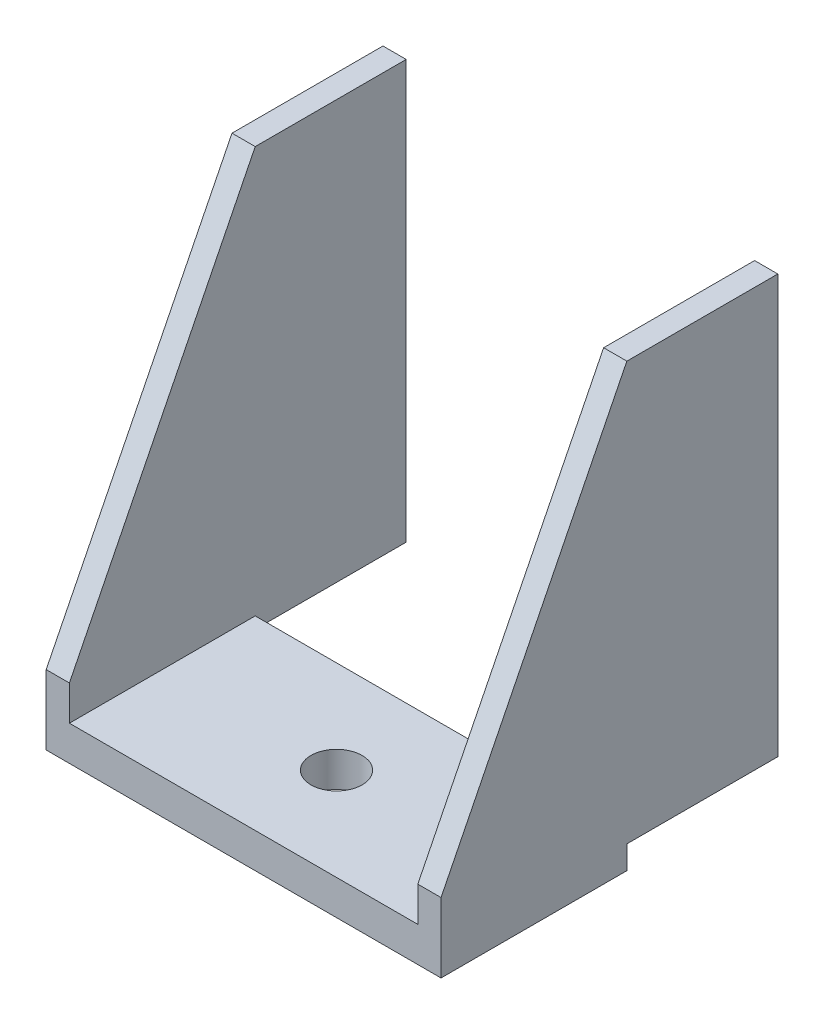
ISO-10303-21;
HEADER;
FILE_DESCRIPTION(('STEP AP214'),'2;1');
FILE_NAME('part.step','',(''),(''),'','','');
FILE_SCHEMA(('AUTOMOTIVE_DESIGN { 1 0 10303 214 1 1 1 1 }'));
ENDSEC;
DATA;
#1=APPLICATION_CONTEXT('core data for automotive mechanical design processes');
#2=APPLICATION_PROTOCOL_DEFINITION('international standard','automotive_design',2000,#1);
#3=PRODUCT_CONTEXT('',#1,'mechanical');
#4=PRODUCT('Part','Part','',(#3));
#5=PRODUCT_RELATED_PRODUCT_CATEGORY('part','',(#4));
#6=PRODUCT_DEFINITION_FORMATION('','',#4);
#7=PRODUCT_DEFINITION_CONTEXT('part definition',#1,'design');
#8=PRODUCT_DEFINITION('design','',#6,#7);
#9=PRODUCT_DEFINITION_SHAPE('','',#8);
#10=(LENGTH_UNIT() NAMED_UNIT(*) SI_UNIT(.MILLI.,.METRE.));
#11=(NAMED_UNIT(*) PLANE_ANGLE_UNIT() SI_UNIT($,.RADIAN.));
#12=(NAMED_UNIT(*) SI_UNIT($,.STERADIAN.) SOLID_ANGLE_UNIT());
#13=UNCERTAINTY_MEASURE_WITH_UNIT(LENGTH_MEASURE(1.E-05),#10,'distance_accuracy_value','');
#14=(GEOMETRIC_REPRESENTATION_CONTEXT(3) GLOBAL_UNCERTAINTY_ASSIGNED_CONTEXT((#13)) GLOBAL_UNIT_ASSIGNED_CONTEXT((#10,
#11,#12)) REPRESENTATION_CONTEXT('',''));
#15=CARTESIAN_POINT('',(0.,0.,0.));
#16=DIRECTION('',(0.,0.,1.));
#17=DIRECTION('',(1.,0.,0.));
#18=AXIS2_PLACEMENT_3D('',#15,#16,#17);
#19=CARTESIAN_POINT('',(0.,15.,0.));
#20=DIRECTION('',(0.,-1.,0.));
#21=DIRECTION('',(0.,0.,-1.));
#22=AXIS2_PLACEMENT_3D('',#19,#20,#21);
#23=PLANE('',#22);
#24=DIRECTION('',(0.,0.,-1.));
#25=VECTOR('',#24,1.);
#26=CARTESIAN_POINT('',(75.,15.,40.));
#27=LINE('',#26,#25);
#28=CARTESIAN_POINT('',(75.,15.,40.));
#29=VERTEX_POINT('',#28);
#30=CARTESIAN_POINT('',(75.,15.,-40.));
#31=VERTEX_POINT('',#30);
#32=EDGE_CURVE('E147',#29,#31,#27,.T.);
#33=ORIENTED_EDGE('',*,*,#32,.T.);
#34=DIRECTION('',(-1.,0.,0.));
#35=VECTOR('',#34,1.);
#36=CARTESIAN_POINT('',(-75.,15.,-40.));
#37=LINE('',#36,#35);
#38=CARTESIAN_POINT('',(-75.,15.,-40.));
#39=VERTEX_POINT('',#38);
#40=EDGE_CURVE('E246',#31,#39,#37,.T.);
#41=ORIENTED_EDGE('',*,*,#40,.T.);
#42=DIRECTION('',(0.,0.,1.));
#43=VECTOR('',#42,1.);
#44=CARTESIAN_POINT('',(-75.,15.,40.));
#45=LINE('',#44,#43);
#46=CARTESIAN_POINT('',(-75.,15.,40.));
#47=VERTEX_POINT('',#46);
#48=EDGE_CURVE('E54',#39,#47,#45,.T.);
#49=ORIENTED_EDGE('',*,*,#48,.T.);
#50=DIRECTION('',(1.,0.,0.));
#51=VECTOR('',#50,1.);
#52=CARTESIAN_POINT('',(-75.,15.,40.));
#53=LINE('',#52,#51);
#54=EDGE_CURVE('E249',#47,#29,#53,.T.);
#55=ORIENTED_EDGE('',*,*,#54,.T.);
#56=EDGE_LOOP('',(#33,#41,#49,#55));
#57=FACE_BOUND('',#56,.T.);
#58=CARTESIAN_POINT('',(0.,15.,0.));
#59=DIRECTION('',(0.,1.,0.));
#60=DIRECTION('',(0.,0.,1.));
#61=AXIS2_PLACEMENT_3D('',#58,#59,#60);
#62=CIRCLE('',#61,11.);
#63=CARTESIAN_POINT('',(0.,15.,11.));
#64=VERTEX_POINT('',#63);
#65=EDGE_CURVE('E239',#64,#64,#62,.T.);
#66=ORIENTED_EDGE('',*,*,#65,.F.);
#67=EDGE_LOOP('',(#66));
#68=FACE_BOUND('',#67,.T.);
#69=ADVANCED_FACE('F33',(#57,#68),#23,.F.);
#70=CARTESIAN_POINT('',(0.,0.,0.));
#71=DIRECTION('',(0.,-1.,0.));
#72=DIRECTION('',(0.,0.,-1.));
#73=AXIS2_PLACEMENT_3D('',#70,#71,#72);
#74=PLANE('',#73);
#75=DIRECTION('',(-1.,0.,0.));
#76=VECTOR('',#75,1.);
#77=CARTESIAN_POINT('',(-75.,0.,-40.));
#78=LINE('',#77,#76);
#79=CARTESIAN_POINT('',(85.,0.,-40.));
#80=VERTEX_POINT('',#79);
#81=CARTESIAN_POINT('',(-85.,0.,-40.));
#82=VERTEX_POINT('',#81);
#83=EDGE_CURVE('E148',#80,#82,#78,.T.);
#84=ORIENTED_EDGE('',*,*,#83,.F.);
#85=DIRECTION('',(0.,0.,-1.));
#86=VECTOR('',#85,1.);
#87=CARTESIAN_POINT('',(85.,0.,40.));
#88=LINE('',#87,#86);
#89=CARTESIAN_POINT('',(85.,0.,40.));
#90=VERTEX_POINT('',#89);
#91=EDGE_CURVE('E142',#90,#80,#88,.T.);
#92=ORIENTED_EDGE('',*,*,#91,.F.);
#93=DIRECTION('',(1.,0.,0.));
#94=VECTOR('',#93,1.);
#95=CARTESIAN_POINT('',(-75.,0.,40.));
#96=LINE('',#95,#94);
#97=CARTESIAN_POINT('',(-85.,0.,40.));
#98=VERTEX_POINT('',#97);
#99=EDGE_CURVE('E135',#98,#90,#96,.T.);
#100=ORIENTED_EDGE('',*,*,#99,.F.);
#101=DIRECTION('',(0.,0.,-1.));
#102=VECTOR('',#101,1.);
#103=CARTESIAN_POINT('',(-85.,0.,40.));
#104=LINE('',#103,#102);
#105=EDGE_CURVE('E139',#98,#82,#104,.T.);
#106=ORIENTED_EDGE('',*,*,#105,.T.);
#107=EDGE_LOOP('',(#84,#92,#100,#106));
#108=FACE_BOUND('',#107,.T.);
#109=CARTESIAN_POINT('',(0.,0.,0.));
#110=DIRECTION('',(0.,1.,0.));
#111=DIRECTION('',(0.,0.,1.));
#112=AXIS2_PLACEMENT_3D('',#109,#110,#111);
#113=CIRCLE('',#112,11.);
#114=CARTESIAN_POINT('',(0.,0.,11.));
#115=VERTEX_POINT('',#114);
#116=EDGE_CURVE('E238',#115,#115,#113,.T.);
#117=ORIENTED_EDGE('',*,*,#116,.T.);
#118=EDGE_LOOP('',(#117));
#119=FACE_BOUND('',#118,.T.);
#120=ADVANCED_FACE('F137',(#108,#119),#74,.T.);
#121=CARTESIAN_POINT('',(-75.,15.,-40.));
#122=DIRECTION('',(0.,0.,1.));
#123=DIRECTION('',(1.,0.,0.));
#124=AXIS2_PLACEMENT_3D('',#121,#122,#123);
#125=PLANE('',#124);
#126=ORIENTED_EDGE('',*,*,#83,.T.);
#127=DIRECTION('',(0.,1.,0.));
#128=VECTOR('',#127,1.);
#129=CARTESIAN_POINT('',(-85.,0.,-40.));
#130=LINE('',#129,#128);
#131=CARTESIAN_POINT('',(-85.,10.,-40.));
#132=VERTEX_POINT('',#131);
#133=EDGE_CURVE('E158',#82,#132,#130,.T.);
#134=ORIENTED_EDGE('',*,*,#133,.T.);
#135=DIRECTION('',(1.,0.,0.));
#136=VECTOR('',#135,1.);
#137=CARTESIAN_POINT('',(-85.,10.,-40.));
#138=LINE('',#137,#136);
#139=CARTESIAN_POINT('',(-75.,10.,-40.));
#140=VERTEX_POINT('',#139);
#141=EDGE_CURVE('E178',#132,#140,#138,.T.);
#142=ORIENTED_EDGE('',*,*,#141,.T.);
#143=DIRECTION('',(0.,-1.,0.));
#144=VECTOR('',#143,1.);
#145=CARTESIAN_POINT('',(-75.,15.,-40.));
#146=LINE('',#145,#144);
#147=EDGE_CURVE('E41',#39,#140,#146,.T.);
#148=ORIENTED_EDGE('',*,*,#147,.F.);
#149=ORIENTED_EDGE('',*,*,#40,.F.);
#150=DIRECTION('',(0.,-1.,0.));
#151=VECTOR('',#150,1.);
#152=CARTESIAN_POINT('',(75.,15.,-40.));
#153=LINE('',#152,#151);
#154=CARTESIAN_POINT('',(75.,10.,-40.));
#155=VERTEX_POINT('',#154);
#156=EDGE_CURVE('E11',#31,#155,#153,.T.);
#157=ORIENTED_EDGE('',*,*,#156,.T.);
#158=DIRECTION('',(-1.,0.,0.));
#159=VECTOR('',#158,1.);
#160=CARTESIAN_POINT('',(85.,10.,-40.));
#161=LINE('',#160,#159);
#162=CARTESIAN_POINT('',(85.,10.,-40.));
#163=VERTEX_POINT('',#162);
#164=EDGE_CURVE('E236',#163,#155,#161,.T.);
#165=ORIENTED_EDGE('',*,*,#164,.F.);
#166=DIRECTION('',(0.,1.,0.));
#167=VECTOR('',#166,1.);
#168=CARTESIAN_POINT('',(85.,0.,-40.));
#169=LINE('',#168,#167);
#170=EDGE_CURVE('E202',#80,#163,#169,.T.);
#171=ORIENTED_EDGE('',*,*,#170,.F.);
#172=EDGE_LOOP('',(#126,#134,#142,#148,#149,#157,#165,#171));
#173=FACE_BOUND('',#172,.T.);
#174=ADVANCED_FACE('F35',(#173),#125,.F.);
#175=CARTESIAN_POINT('',(-75.,15.,40.));
#176=DIRECTION('',(0.,0.,-1.));
#177=DIRECTION('',(-1.,0.,0.));
#178=AXIS2_PLACEMENT_3D('',#175,#176,#177);
#179=PLANE('',#178);
#180=ORIENTED_EDGE('',*,*,#99,.T.);
#181=DIRECTION('',(0.,-1.,0.));
#182=VECTOR('',#181,1.);
#183=CARTESIAN_POINT('',(85.,30.,40.));
#184=LINE('',#183,#182);
#185=CARTESIAN_POINT('',(85.,30.,40.));
#186=VERTEX_POINT('',#185);
#187=EDGE_CURVE('E213',#186,#90,#184,.T.);
#188=ORIENTED_EDGE('',*,*,#187,.F.);
#189=DIRECTION('',(-1.,0.,0.));
#190=VECTOR('',#189,1.);
#191=CARTESIAN_POINT('',(85.,30.,40.));
#192=LINE('',#191,#190);
#193=CARTESIAN_POINT('',(75.,30.,40.));
#194=VERTEX_POINT('',#193);
#195=EDGE_CURVE('E215',#186,#194,#192,.T.);
#196=ORIENTED_EDGE('',*,*,#195,.T.);
#197=DIRECTION('',(0.,-1.,0.));
#198=VECTOR('',#197,1.);
#199=CARTESIAN_POINT('',(75.,30.,40.));
#200=LINE('',#199,#198);
#201=EDGE_CURVE('E203',#194,#29,#200,.T.);
#202=ORIENTED_EDGE('',*,*,#201,.T.);
#203=ORIENTED_EDGE('',*,*,#54,.F.);
#204=DIRECTION('',(0.,-1.,0.));
#205=VECTOR('',#204,1.);
#206=CARTESIAN_POINT('',(-75.,30.,40.));
#207=LINE('',#206,#205);
#208=CARTESIAN_POINT('',(-75.,30.,40.));
#209=VERTEX_POINT('',#208);
#210=EDGE_CURVE('E179',#209,#47,#207,.T.);
#211=ORIENTED_EDGE('',*,*,#210,.F.);
#212=DIRECTION('',(1.,0.,0.));
#213=VECTOR('',#212,1.);
#214=CARTESIAN_POINT('',(-85.,30.,40.));
#215=LINE('',#214,#213);
#216=CARTESIAN_POINT('',(-85.,30.,40.));
#217=VERTEX_POINT('',#216);
#218=EDGE_CURVE('E163',#217,#209,#215,.T.);
#219=ORIENTED_EDGE('',*,*,#218,.F.);
#220=DIRECTION('',(0.,-1.,0.));
#221=VECTOR('',#220,1.);
#222=CARTESIAN_POINT('',(-85.,30.,40.));
#223=LINE('',#222,#221);
#224=EDGE_CURVE('E154',#217,#98,#223,.T.);
#225=ORIENTED_EDGE('',*,*,#224,.T.);
#226=EDGE_LOOP('',(#180,#188,#196,#202,#203,#211,#219,#225));
#227=FACE_BOUND('',#226,.T.);
#228=ADVANCED_FACE('F161',(#227),#179,.F.);
#229=CARTESIAN_POINT('',(0.,15.,0.));
#230=DIRECTION('',(0.,-1.,0.));
#231=DIRECTION('',(0.,0.,-1.));
#232=AXIS2_PLACEMENT_3D('',#229,#230,#231);
#233=CYLINDRICAL_SURFACE('',#232,11.);
#234=ORIENTED_EDGE('',*,*,#65,.T.);
#235=EDGE_LOOP('',(#234));
#236=FACE_BOUND('',#235,.T.);
#237=ORIENTED_EDGE('',*,*,#116,.F.);
#238=EDGE_LOOP('',(#237));
#239=FACE_BOUND('',#238,.T.);
#240=ADVANCED_FACE('F299',(#236,#239),#233,.F.);
#241=CARTESIAN_POINT('',(85.,10.,-40.));
#242=DIRECTION('',(0.,1.,0.));
#243=DIRECTION('',(0.,0.,1.));
#244=AXIS2_PLACEMENT_3D('',#241,#242,#243);
#245=PLANE('',#244);
#246=DIRECTION('',(0.,0.,-1.));
#247=VECTOR('',#246,1.);
#248=CARTESIAN_POINT('',(75.,10.,-40.));
#249=LINE('',#248,#247);
#250=CARTESIAN_POINT('',(75.,10.,-105.));
#251=VERTEX_POINT('',#250);
#252=EDGE_CURVE('E200',#155,#251,#249,.T.);
#253=ORIENTED_EDGE('',*,*,#252,.T.);
#254=DIRECTION('',(-1.,0.,0.));
#255=VECTOR('',#254,1.);
#256=CARTESIAN_POINT('',(85.,10.,-105.));
#257=LINE('',#256,#255);
#258=CARTESIAN_POINT('',(85.,10.,-105.));
#259=VERTEX_POINT('',#258);
#260=EDGE_CURVE('E233',#259,#251,#257,.T.);
#261=ORIENTED_EDGE('',*,*,#260,.F.);
#262=DIRECTION('',(0.,0.,-1.));
#263=VECTOR('',#262,1.);
#264=CARTESIAN_POINT('',(85.,10.,-40.));
#265=LINE('',#264,#263);
#266=EDGE_CURVE('E205',#163,#259,#265,.T.);
#267=ORIENTED_EDGE('',*,*,#266,.F.);
#268=ORIENTED_EDGE('',*,*,#164,.T.);
#269=EDGE_LOOP('',(#253,#261,#267,#268));
#270=FACE_BOUND('',#269,.T.);
#271=ADVANCED_FACE('F306',(#270),#245,.F.);
#272=CARTESIAN_POINT('',(85.,10.,-105.));
#273=DIRECTION('',(0.,0.,1.));
#274=DIRECTION('',(1.,0.,0.));
#275=AXIS2_PLACEMENT_3D('',#272,#273,#274);
#276=PLANE('',#275);
#277=DIRECTION('',(0.,1.,0.));
#278=VECTOR('',#277,1.);
#279=CARTESIAN_POINT('',(75.,10.,-105.));
#280=LINE('',#279,#278);
#281=CARTESIAN_POINT('',(75.,190.,-105.));
#282=VERTEX_POINT('',#281);
#283=EDGE_CURVE('E217',#251,#282,#280,.T.);
#284=ORIENTED_EDGE('',*,*,#283,.T.);
#285=DIRECTION('',(-1.,0.,0.));
#286=VECTOR('',#285,1.);
#287=CARTESIAN_POINT('',(85.,190.,-105.));
#288=LINE('',#287,#286);
#289=CARTESIAN_POINT('',(85.,190.,-105.));
#290=VERTEX_POINT('',#289);
#291=EDGE_CURVE('E230',#290,#282,#288,.T.);
#292=ORIENTED_EDGE('',*,*,#291,.F.);
#293=DIRECTION('',(0.,1.,0.));
#294=VECTOR('',#293,1.);
#295=CARTESIAN_POINT('',(85.,10.,-105.));
#296=LINE('',#295,#294);
#297=EDGE_CURVE('E207',#259,#290,#296,.T.);
#298=ORIENTED_EDGE('',*,*,#297,.F.);
#299=ORIENTED_EDGE('',*,*,#260,.T.);
#300=EDGE_LOOP('',(#284,#292,#298,#299));
#301=FACE_BOUND('',#300,.T.);
#302=ADVANCED_FACE('F356',(#301),#276,.F.);
#303=CARTESIAN_POINT('',(85.,190.,-105.));
#304=DIRECTION('',(0.,-1.,0.));
#305=DIRECTION('',(0.,0.,-1.));
#306=AXIS2_PLACEMENT_3D('',#303,#304,#305);
#307=PLANE('',#306);
#308=DIRECTION('',(0.,0.,1.));
#309=VECTOR('',#308,1.);
#310=CARTESIAN_POINT('',(75.,190.,-105.));
#311=LINE('',#310,#309);
#312=CARTESIAN_POINT('',(75.,190.,-40.));
#313=VERTEX_POINT('',#312);
#314=EDGE_CURVE('E219',#282,#313,#311,.T.);
#315=ORIENTED_EDGE('',*,*,#314,.T.);
#316=DIRECTION('',(-1.,0.,0.));
#317=VECTOR('',#316,1.);
#318=CARTESIAN_POINT('',(85.,190.,-40.));
#319=LINE('',#318,#317);
#320=CARTESIAN_POINT('',(85.,190.,-40.));
#321=VERTEX_POINT('',#320);
#322=EDGE_CURVE('E227',#321,#313,#319,.T.);
#323=ORIENTED_EDGE('',*,*,#322,.F.);
#324=DIRECTION('',(0.,0.,1.));
#325=VECTOR('',#324,1.);
#326=CARTESIAN_POINT('',(85.,190.,-105.));
#327=LINE('',#326,#325);
#328=EDGE_CURVE('E209',#290,#321,#327,.T.);
#329=ORIENTED_EDGE('',*,*,#328,.F.);
#330=ORIENTED_EDGE('',*,*,#291,.T.);
#331=EDGE_LOOP('',(#315,#323,#329,#330));
#332=FACE_BOUND('',#331,.T.);
#333=ADVANCED_FACE('F347',(#332),#307,.F.);
#334=CARTESIAN_POINT('',(85.,190.,-40.));
#335=DIRECTION('',(0.,-0.447213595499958,-0.894427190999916));
#336=DIRECTION('',(0.,0.894427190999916,-0.447213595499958));
#337=AXIS2_PLACEMENT_3D('',#334,#335,#336);
#338=PLANE('',#337);
#339=DIRECTION('',(0.,-0.894427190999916,0.447213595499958));
#340=VECTOR('',#339,1.);
#341=CARTESIAN_POINT('',(75.,190.,-40.));
#342=LINE('',#341,#340);
#343=EDGE_CURVE('E221',#313,#194,#342,.T.);
#344=ORIENTED_EDGE('',*,*,#343,.T.);
#345=ORIENTED_EDGE('',*,*,#195,.F.);
#346=DIRECTION('',(0.,-0.894427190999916,0.447213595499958));
#347=VECTOR('',#346,1.);
#348=CARTESIAN_POINT('',(85.,190.,-40.));
#349=LINE('',#348,#347);
#350=EDGE_CURVE('E211',#321,#186,#349,.T.);
#351=ORIENTED_EDGE('',*,*,#350,.F.);
#352=ORIENTED_EDGE('',*,*,#322,.T.);
#353=EDGE_LOOP('',(#344,#345,#351,#352));
#354=FACE_BOUND('',#353,.T.);
#355=ADVANCED_FACE('F338',(#354),#338,.F.);
#356=CARTESIAN_POINT('',(85.,0.,0.));
#357=DIRECTION('',(1.,0.,0.));
#358=DIRECTION('',(0.,0.,-1.));
#359=AXIS2_PLACEMENT_3D('',#356,#357,#358);
#360=PLANE('',#359);
#361=ORIENTED_EDGE('',*,*,#91,.T.);
#362=ORIENTED_EDGE('',*,*,#170,.T.);
#363=ORIENTED_EDGE('',*,*,#266,.T.);
#364=ORIENTED_EDGE('',*,*,#297,.T.);
#365=ORIENTED_EDGE('',*,*,#328,.T.);
#366=ORIENTED_EDGE('',*,*,#350,.T.);
#367=ORIENTED_EDGE('',*,*,#187,.T.);
#368=EDGE_LOOP('',(#361,#362,#363,#364,#365,#366,#367));
#369=FACE_BOUND('',#368,.T.);
#370=ADVANCED_FACE('F256',(#369),#360,.T.);
#371=CARTESIAN_POINT('',(75.,0.,0.));
#372=DIRECTION('',(1.,0.,0.));
#373=DIRECTION('',(0.,0.,-1.));
#374=AXIS2_PLACEMENT_3D('',#371,#372,#373);
#375=PLANE('',#374);
#376=ORIENTED_EDGE('',*,*,#156,.F.);
#377=ORIENTED_EDGE('',*,*,#32,.F.);
#378=ORIENTED_EDGE('',*,*,#201,.F.);
#379=ORIENTED_EDGE('',*,*,#343,.F.);
#380=ORIENTED_EDGE('',*,*,#314,.F.);
#381=ORIENTED_EDGE('',*,*,#283,.F.);
#382=ORIENTED_EDGE('',*,*,#252,.F.);
#383=EDGE_LOOP('',(#376,#377,#378,#379,#380,#381,#382));
#384=FACE_BOUND('',#383,.T.);
#385=ADVANCED_FACE('F263',(#384),#375,.F.);
#386=CARTESIAN_POINT('',(-85.,190.,-40.));
#387=DIRECTION('',(0.,0.447213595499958,0.894427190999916));
#388=DIRECTION('',(0.,-0.894427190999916,0.447213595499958));
#389=AXIS2_PLACEMENT_3D('',#386,#387,#388);
#390=PLANE('',#389);
#391=DIRECTION('',(0.,-0.894427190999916,0.447213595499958));
#392=VECTOR('',#391,1.);
#393=CARTESIAN_POINT('',(-75.,190.,-40.));
#394=LINE('',#393,#392);
#395=CARTESIAN_POINT('',(-75.,190.,-40.));
#396=VERTEX_POINT('',#395);
#397=EDGE_CURVE('E182',#396,#209,#394,.T.);
#398=ORIENTED_EDGE('',*,*,#397,.F.);
#399=DIRECTION('',(1.,0.,0.));
#400=VECTOR('',#399,1.);
#401=CARTESIAN_POINT('',(-85.,190.,-40.));
#402=LINE('',#401,#400);
#403=CARTESIAN_POINT('',(-85.,190.,-40.));
#404=VERTEX_POINT('',#403);
#405=EDGE_CURVE('E197',#404,#396,#402,.T.);
#406=ORIENTED_EDGE('',*,*,#405,.F.);
#407=DIRECTION('',(0.,-0.894427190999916,0.447213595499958));
#408=VECTOR('',#407,1.);
#409=CARTESIAN_POINT('',(-85.,190.,-40.));
#410=LINE('',#409,#408);
#411=EDGE_CURVE('E164',#404,#217,#410,.T.);
#412=ORIENTED_EDGE('',*,*,#411,.T.);
#413=ORIENTED_EDGE('',*,*,#218,.T.);
#414=EDGE_LOOP('',(#398,#406,#412,#413));
#415=FACE_BOUND('',#414,.T.);
#416=ADVANCED_FACE('F272',(#415),#390,.T.);
#417=CARTESIAN_POINT('',(-85.,190.,-105.));
#418=DIRECTION('',(0.,1.,0.));
#419=DIRECTION('',(0.,0.,1.));
#420=AXIS2_PLACEMENT_3D('',#417,#418,#419);
#421=PLANE('',#420);
#422=DIRECTION('',(0.,0.,1.));
#423=VECTOR('',#422,1.);
#424=CARTESIAN_POINT('',(-75.,190.,-105.));
#425=LINE('',#424,#423);
#426=CARTESIAN_POINT('',(-75.,190.,-105.));
#427=VERTEX_POINT('',#426);
#428=EDGE_CURVE('E185',#427,#396,#425,.T.);
#429=ORIENTED_EDGE('',*,*,#428,.F.);
#430=DIRECTION('',(1.,0.,0.));
#431=VECTOR('',#430,1.);
#432=CARTESIAN_POINT('',(-85.,190.,-105.));
#433=LINE('',#432,#431);
#434=CARTESIAN_POINT('',(-85.,190.,-105.));
#435=VERTEX_POINT('',#434);
#436=EDGE_CURVE('E195',#435,#427,#433,.T.);
#437=ORIENTED_EDGE('',*,*,#436,.F.);
#438=DIRECTION('',(0.,0.,1.));
#439=VECTOR('',#438,1.);
#440=CARTESIAN_POINT('',(-85.,190.,-105.));
#441=LINE('',#440,#439);
#442=EDGE_CURVE('E166',#435,#404,#441,.T.);
#443=ORIENTED_EDGE('',*,*,#442,.T.);
#444=ORIENTED_EDGE('',*,*,#405,.T.);
#445=EDGE_LOOP('',(#429,#437,#443,#444));
#446=FACE_BOUND('',#445,.T.);
#447=ADVANCED_FACE('F276',(#446),#421,.T.);
#448=CARTESIAN_POINT('',(-85.,10.,-105.));
#449=DIRECTION('',(0.,0.,-1.));
#450=DIRECTION('',(-1.,0.,0.));
#451=AXIS2_PLACEMENT_3D('',#448,#449,#450);
#452=PLANE('',#451);
#453=DIRECTION('',(0.,1.,0.));
#454=VECTOR('',#453,1.);
#455=CARTESIAN_POINT('',(-75.,10.,-105.));
#456=LINE('',#455,#454);
#457=CARTESIAN_POINT('',(-75.,10.,-105.));
#458=VERTEX_POINT('',#457);
#459=EDGE_CURVE('E188',#458,#427,#456,.T.);
#460=ORIENTED_EDGE('',*,*,#459,.F.);
#461=DIRECTION('',(1.,0.,0.));
#462=VECTOR('',#461,1.);
#463=CARTESIAN_POINT('',(-85.,10.,-105.));
#464=LINE('',#463,#462);
#465=CARTESIAN_POINT('',(-85.,10.,-105.));
#466=VERTEX_POINT('',#465);
#467=EDGE_CURVE('E193',#466,#458,#464,.T.);
#468=ORIENTED_EDGE('',*,*,#467,.F.);
#469=DIRECTION('',(0.,1.,0.));
#470=VECTOR('',#469,1.);
#471=CARTESIAN_POINT('',(-85.,10.,-105.));
#472=LINE('',#471,#470);
#473=EDGE_CURVE('E171',#466,#435,#472,.T.);
#474=ORIENTED_EDGE('',*,*,#473,.T.);
#475=ORIENTED_EDGE('',*,*,#436,.T.);
#476=EDGE_LOOP('',(#460,#468,#474,#475));
#477=FACE_BOUND('',#476,.T.);
#478=ADVANCED_FACE('F279',(#477),#452,.T.);
#479=CARTESIAN_POINT('',(-85.,10.,-40.));
#480=DIRECTION('',(0.,-1.,0.));
#481=DIRECTION('',(0.,0.,-1.));
#482=AXIS2_PLACEMENT_3D('',#479,#480,#481);
#483=PLANE('',#482);
#484=DIRECTION('',(0.,0.,-1.));
#485=VECTOR('',#484,1.);
#486=CARTESIAN_POINT('',(-75.,10.,-40.));
#487=LINE('',#486,#485);
#488=EDGE_CURVE('E159',#140,#458,#487,.T.);
#489=ORIENTED_EDGE('',*,*,#488,.F.);
#490=ORIENTED_EDGE('',*,*,#141,.F.);
#491=DIRECTION('',(0.,0.,-1.));
#492=VECTOR('',#491,1.);
#493=CARTESIAN_POINT('',(-85.,10.,-40.));
#494=LINE('',#493,#492);
#495=EDGE_CURVE('E174',#132,#466,#494,.T.);
#496=ORIENTED_EDGE('',*,*,#495,.T.);
#497=ORIENTED_EDGE('',*,*,#467,.T.);
#498=EDGE_LOOP('',(#489,#490,#496,#497));
#499=FACE_BOUND('',#498,.T.);
#500=ADVANCED_FACE('F282',(#499),#483,.T.);
#501=CARTESIAN_POINT('',(-85.,0.,0.));
#502=DIRECTION('',(-1.,0.,0.));
#503=DIRECTION('',(0.,0.,-1.));
#504=AXIS2_PLACEMENT_3D('',#501,#502,#503);
#505=PLANE('',#504);
#506=ORIENTED_EDGE('',*,*,#105,.F.);
#507=ORIENTED_EDGE('',*,*,#224,.F.);
#508=ORIENTED_EDGE('',*,*,#411,.F.);
#509=ORIENTED_EDGE('',*,*,#442,.F.);
#510=ORIENTED_EDGE('',*,*,#473,.F.);
#511=ORIENTED_EDGE('',*,*,#495,.F.);
#512=ORIENTED_EDGE('',*,*,#133,.F.);
#513=EDGE_LOOP('',(#506,#507,#508,#509,#510,#511,#512));
#514=FACE_BOUND('',#513,.T.);
#515=ADVANCED_FACE('F152',(#514),#505,.T.);
#516=CARTESIAN_POINT('',(-75.,0.,0.));
#517=DIRECTION('',(-1.,0.,0.));
#518=DIRECTION('',(0.,0.,-1.));
#519=AXIS2_PLACEMENT_3D('',#516,#517,#518);
#520=PLANE('',#519);
#521=ORIENTED_EDGE('',*,*,#48,.F.);
#522=ORIENTED_EDGE('',*,*,#147,.T.);
#523=ORIENTED_EDGE('',*,*,#488,.T.);
#524=ORIENTED_EDGE('',*,*,#459,.T.);
#525=ORIENTED_EDGE('',*,*,#428,.T.);
#526=ORIENTED_EDGE('',*,*,#397,.T.);
#527=ORIENTED_EDGE('',*,*,#210,.T.);
#528=EDGE_LOOP('',(#521,#522,#523,#524,#525,#526,#527));
#529=FACE_BOUND('',#528,.T.);
#530=ADVANCED_FACE('F268',(#529),#520,.F.);
#531=CLOSED_SHELL('',(#69,#120,#174,#228,#240,#271,#302,#333,#355,#370,#385,#416,#447,#478,#500,
#515,#530));
#532=MANIFOLD_SOLID_BREP('B2',#531);
#533=ADVANCED_BREP_SHAPE_REPRESENTATION('',(#18,#532),#14);
#534=SHAPE_DEFINITION_REPRESENTATION(#9,#533);
ENDSEC;
END-ISO-10303-21;
